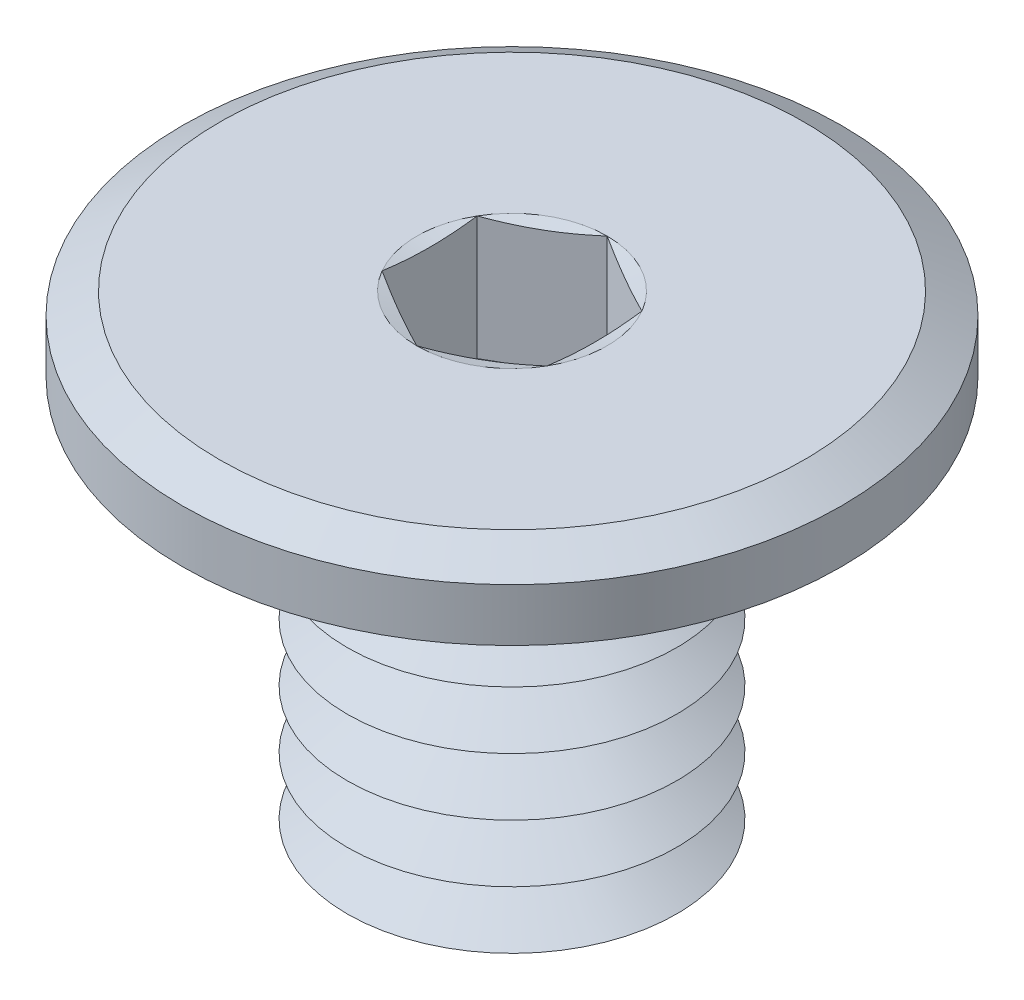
from build123d import *

# Parameters (mm, degrees)
SKETCH1_R           = 4
BOSS_EXTRUDE1_DEPTH = 0.9
SKETCH2_R           = 2
BOSS_EXTRUDE2_DEPTH = 5
LPATTERN1_COUNT     = 6
LPATTERN1_PITCH     = 0.7
FILLET1_R           = 0.2
CHAMFER2_SIZE       = 0.45
CHAMFER2_SIZE2      = 0.259807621
CUT_EXTRUDE1_DEPTH  = 1.5


with BuildPart() as part:
    # Sketch1 → Boss-Extrude1 (new body)
    with BuildSketch(Plane(origin=(0, 0, 0), x_dir=(1, 0, 0), z_dir=(0, 1, 0))):
        with Locations(Location((0, 0, 0), (0, 0, 270))):
            Circle(SKETCH1_R)
    extrude(amount=-BOSS_EXTRUDE1_DEPTH)

    # Sketch2 → Boss-Extrude2 (add)
    with BuildSketch(Plane.XZ.offset(0.9)):
        with Locations(Location((0, 0, 0), (0, 0, 270))):
            Circle(SKETCH2_R)
    extrude(amount=BOSS_EXTRUDE2_DEPTH)

    # Sketch5 → Cut-Revolve1 (revolve, cut)
    with BuildSketch(Plane(origin=(0, 0, 0), x_dir=(0, 0, -1), z_dir=(1, 0, 0))):
        Polygon((-2, -6.25), (-1.393782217, -5.9), (-2, -5.55), align=None)
    cut_revolve1 = revolve(axis=Axis((0, 0.990593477, 0), (0, -1, 0)), mode=Mode.SUBTRACT)

    # LPattern1: Cut-Revolve1 ×6
    with Locations(*[(0, i * LPATTERN1_PITCH, 0) for i in range(1, LPATTERN1_COUNT)]):
        add(cut_revolve1, mode=Mode.SUBTRACT)

    # Fillet1
    fillet1_edges = [part.edges().sort_by_distance(p)[0] for p in [
        (0, -0.9, 2),
    ]]
    fillet(fillet1_edges, radius=FILLET1_R)

    # Chamfer2
    chamfer2_edges = [part.edges().sort_by_distance(p)[0] for p in [
        (0, 0, -4),
    ]]
    chamfer2_side = [part.faces().sort_by_distance(p)[0] for p in [
        (0, 0, 0),
    ]]
    chamfer(chamfer2_edges, length=CHAMFER2_SIZE, length2=CHAMFER2_SIZE2, reference=chamfer2_side[0])

    # Sketch6 → Cut-Extrude1 (cut)
    with BuildSketch(Plane(origin=(0, 0, 0), x_dir=(1, 0, 0), z_dir=(0, 1, 0))):
        Polygon((0, 1.154700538), (-1, 0.577350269), (-1, -0.577350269), (0, -1.154700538), (1, -0.577350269), (1, 0.577350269), align=None)
    extrude(amount=-CUT_EXTRUDE1_DEPTH, mode=Mode.SUBTRACT)

    # Cut-Extrude2 cone 1 section (on through the dimple's axis) → Cut-Extrude2 (revolve, cut)
    with BuildSketch(Plane(origin=(0, -1.5, 0), x_dir=(0, 0, 1), z_dir=(1, 0, 0))):
        Polygon((0, 0), (1, 0), (0, 0.577350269), align=None)
    revolve(axis=Axis((0, -1.5, 0), (0, -1, 0)), mode=Mode.SUBTRACT)

    # Cut-Extrude3 cone 1 section (on through the dimple's axis) → Cut-Extrude3 (revolve, cut)
    with BuildSketch(Plane(origin=(0, 0, 0), x_dir=(0, 0, 1), z_dir=(1, 0, 0))):
        Polygon((0, 0), (1.154700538, 0), (0, 0.309401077), align=None)
    revolve(axis=Axis((0, 0, 0), (0, -1, 0)), mode=Mode.SUBTRACT)


solid = part.part
